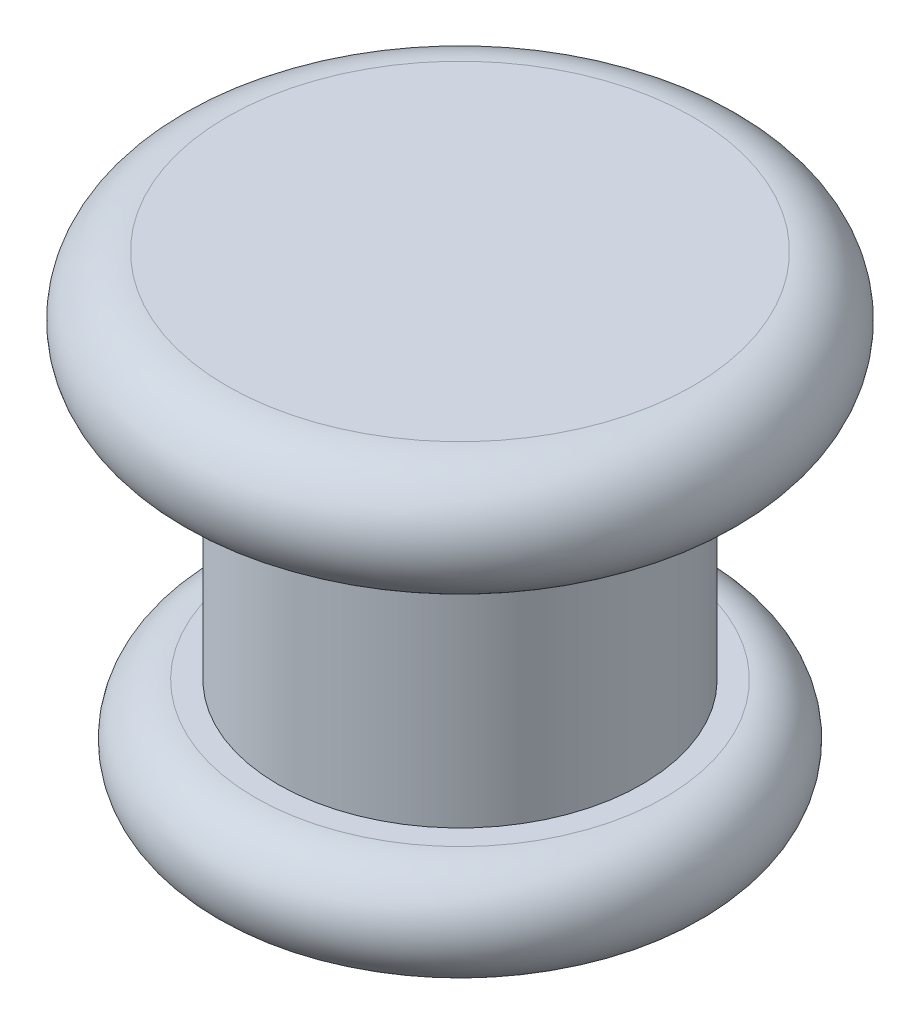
from build123d import *


with BuildPart() as part:
    # Sketch6 → Revolve2 (revolve)
    with BuildSketch(Plane.XY, mode=Mode.PRIVATE) as revolve2_sk:
        with BuildLine():
            Line((0, 0), (0, -20.5486))
            Line((0, -20.5486), (8.89, -20.5486))
            ThreePointArc((8.89, -20.5486), (11.1125, -18.3261), (8.89, -16.1036))
            Line((8.89, -16.1036), (7.8994, -16.1036))
            Line((7.8994, -16.1036), (7.8994, -5.1562))
            Line((7.8994, -5.1562), (10.1219, -5.1562))
            ThreePointArc((10.1219, -5.1562), (12.7, -2.5781), (10.1219, 0))
            Line((10.1219, 0), (0, 0))
        make_face()
    revolve(revolve2_sk.sketch.rotate(Axis((0, 5.720677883, 0), (0, -1, 0)), 90), axis=Axis((0, 5.720677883, 0), (0, -1, 0)))


solid = part.part
